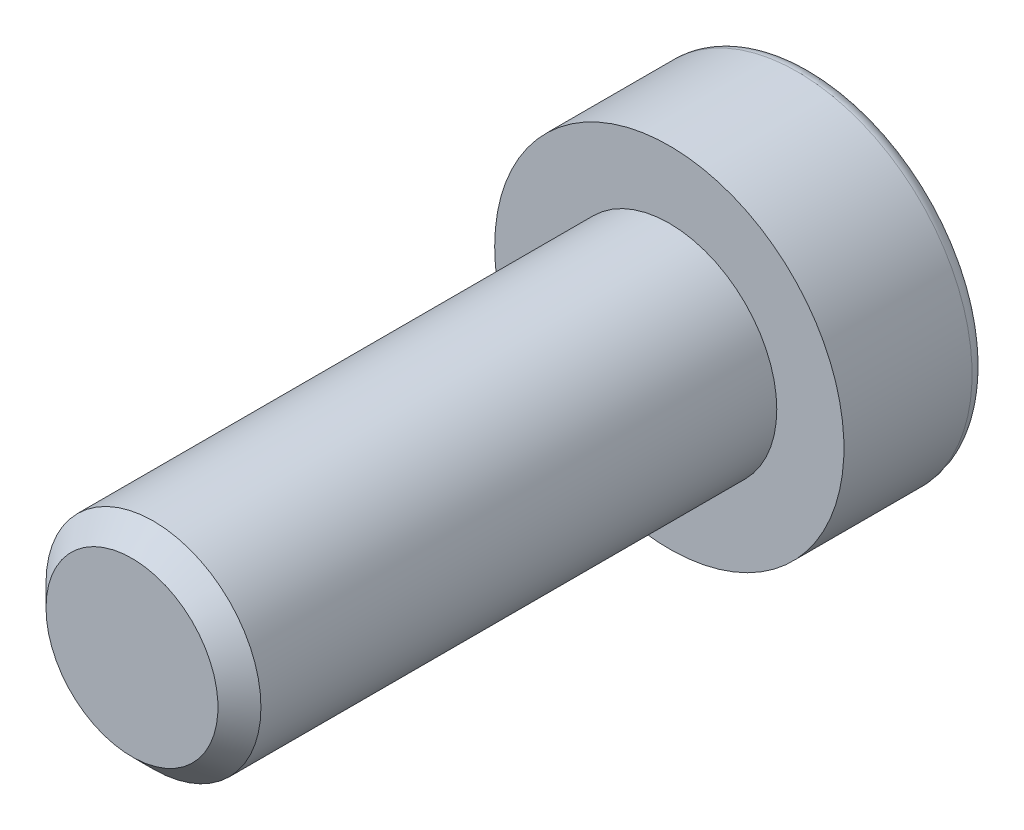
ISO-10303-21;
HEADER;
FILE_DESCRIPTION(('STEP AP214'),'2;1');
FILE_NAME('part.step','',(''),(''),'','','');
FILE_SCHEMA(('AUTOMOTIVE_DESIGN { 1 0 10303 214 1 1 1 1 }'));
ENDSEC;
DATA;
#1=APPLICATION_CONTEXT('core data for automotive mechanical design processes');
#2=APPLICATION_PROTOCOL_DEFINITION('international standard','automotive_design',2000,#1);
#3=PRODUCT_CONTEXT('',#1,'mechanical');
#4=PRODUCT('Part','Part','',(#3));
#5=PRODUCT_RELATED_PRODUCT_CATEGORY('part','',(#4));
#6=PRODUCT_DEFINITION_FORMATION('','',#4);
#7=PRODUCT_DEFINITION_CONTEXT('part definition',#1,'design');
#8=PRODUCT_DEFINITION('design','',#6,#7);
#9=PRODUCT_DEFINITION_SHAPE('','',#8);
#10=(LENGTH_UNIT() NAMED_UNIT(*) SI_UNIT(.MILLI.,.METRE.));
#11=(NAMED_UNIT(*) PLANE_ANGLE_UNIT() SI_UNIT($,.RADIAN.));
#12=(NAMED_UNIT(*) SI_UNIT($,.STERADIAN.) SOLID_ANGLE_UNIT());
#13=UNCERTAINTY_MEASURE_WITH_UNIT(LENGTH_MEASURE(1.E-05),#10,'distance_accuracy_value','');
#14=(GEOMETRIC_REPRESENTATION_CONTEXT(3) GLOBAL_UNCERTAINTY_ASSIGNED_CONTEXT((#13)) GLOBAL_UNIT_ASSIGNED_CONTEXT((#10,
#11,#12)) REPRESENTATION_CONTEXT('',''));
#15=CARTESIAN_POINT('',(0.,0.,0.));
#16=DIRECTION('',(0.,0.,1.));
#17=DIRECTION('',(1.,0.,0.));
#18=AXIS2_PLACEMENT_3D('',#15,#16,#17);
#19=CARTESIAN_POINT('',(0.,0.,-5.3));
#20=DIRECTION('',(0.,0.,1.));
#21=DIRECTION('',(1.,0.,0.));
#22=AXIS2_PLACEMENT_3D('',#19,#20,#21);
#23=PLANE('',#22);
#24=CARTESIAN_POINT('',(0.,0.,-5.3));
#25=DIRECTION('',(0.,0.,-1.));
#26=DIRECTION('',(-1.,0.,0.));
#27=AXIS2_PLACEMENT_3D('',#24,#25,#26);
#28=CIRCLE('',#27,5.97);
#29=CARTESIAN_POINT('',(-5.97,0.,-5.3));
#30=VERTEX_POINT('',#29);
#31=EDGE_CURVE('E141',#30,#30,#28,.T.);
#32=ORIENTED_EDGE('',*,*,#31,.T.);
#33=EDGE_LOOP('',(#32));
#34=FACE_BOUND('',#33,.T.);
#35=DIRECTION('',(-0.86602540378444,0.499999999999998,0.));
#36=VECTOR('',#35,1.);
#37=CARTESIAN_POINT('',(0.,3.46410161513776,-5.3));
#38=LINE('',#37,#36);
#39=CARTESIAN_POINT('',(3.,1.73205080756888,-5.3));
#40=VERTEX_POINT('',#39);
#41=CARTESIAN_POINT('',(0.,3.46410161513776,-5.3));
#42=VERTEX_POINT('',#41);
#43=EDGE_CURVE('E45',#40,#42,#38,.T.);
#44=ORIENTED_EDGE('',*,*,#43,.T.);
#45=DIRECTION('',(-0.866025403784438,-0.500000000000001,0.));
#46=VECTOR('',#45,1.);
#47=CARTESIAN_POINT('',(0.,3.46410161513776,-5.3));
#48=LINE('',#47,#46);
#49=CARTESIAN_POINT('',(-3.,1.73205080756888,-5.3));
#50=VERTEX_POINT('',#49);
#51=EDGE_CURVE('E85',#42,#50,#48,.T.);
#52=ORIENTED_EDGE('',*,*,#51,.T.);
#53=DIRECTION('',(0.,-1.,0.));
#54=VECTOR('',#53,1.);
#55=CARTESIAN_POINT('',(-3.,-1.73205080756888,-5.3));
#56=LINE('',#55,#54);
#57=CARTESIAN_POINT('',(-3.,-1.73205080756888,-5.3));
#58=VERTEX_POINT('',#57);
#59=EDGE_CURVE('E93',#50,#58,#56,.T.);
#60=ORIENTED_EDGE('',*,*,#59,.T.);
#61=DIRECTION('',(0.866025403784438,-0.500000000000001,0.));
#62=VECTOR('',#61,1.);
#63=CARTESIAN_POINT('',(0.,-3.46410161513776,-5.3));
#64=LINE('',#63,#62);
#65=CARTESIAN_POINT('',(0.,-3.46410161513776,-5.3));
#66=VERTEX_POINT('',#65);
#67=EDGE_CURVE('E111',#58,#66,#64,.T.);
#68=ORIENTED_EDGE('',*,*,#67,.T.);
#69=DIRECTION('',(0.86602540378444,0.499999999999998,0.));
#70=VECTOR('',#69,1.);
#71=CARTESIAN_POINT('',(0.,-3.46410161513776,-5.3));
#72=LINE('',#71,#70);
#73=CARTESIAN_POINT('',(3.,-1.73205080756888,-5.3));
#74=VERTEX_POINT('',#73);
#75=EDGE_CURVE('E114',#66,#74,#72,.T.);
#76=ORIENTED_EDGE('',*,*,#75,.T.);
#77=DIRECTION('',(0.,1.,0.));
#78=VECTOR('',#77,1.);
#79=CARTESIAN_POINT('',(3.,-1.73205080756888,-5.3));
#80=LINE('',#79,#78);
#81=EDGE_CURVE('E104',#74,#40,#80,.T.);
#82=ORIENTED_EDGE('',*,*,#81,.T.);
#83=EDGE_LOOP('',(#44,#52,#60,#68,#76,#82));
#84=FACE_BOUND('',#83,.T.);
#85=ADVANCED_FACE('F31',(#34,#84),#23,.F.);
#86=CARTESIAN_POINT('',(0.,0.,-4.77));
#87=DIRECTION('',(0.,0.,-1.));
#88=DIRECTION('',(-1.,0.,0.));
#89=AXIS2_PLACEMENT_3D('',#86,#87,#88);
#90=TOROIDAL_SURFACE('',#89,5.97,0.53);
#91=ORIENTED_EDGE('',*,*,#31,.F.);
#92=EDGE_LOOP('',(#91));
#93=FACE_BOUND('',#92,.T.);
#94=CARTESIAN_POINT('',(0.,0.,-4.77));
#95=DIRECTION('',(0.,0.,-1.));
#96=DIRECTION('',(-1.,0.,0.));
#97=AXIS2_PLACEMENT_3D('',#94,#95,#96);
#98=CIRCLE('',#97,6.5);
#99=CARTESIAN_POINT('',(-6.5,0.,-4.77));
#100=VERTEX_POINT('',#99);
#101=EDGE_CURVE('E138',#100,#100,#98,.T.);
#102=ORIENTED_EDGE('',*,*,#101,.T.);
#103=EDGE_LOOP('',(#102));
#104=FACE_BOUND('',#103,.T.);
#105=ADVANCED_FACE('F160',(#93,#104),#90,.T.);
#106=CARTESIAN_POINT('',(0.,0.,0.));
#107=DIRECTION('',(0.,0.,-1.));
#108=DIRECTION('',(-1.,0.,0.));
#109=AXIS2_PLACEMENT_3D('',#106,#107,#108);
#110=CYLINDRICAL_SURFACE('',#109,6.5);
#111=ORIENTED_EDGE('',*,*,#101,.F.);
#112=EDGE_LOOP('',(#111));
#113=FACE_BOUND('',#112,.T.);
#114=CARTESIAN_POINT('',(0.,0.,0.));
#115=DIRECTION('',(0.,0.,-1.));
#116=DIRECTION('',(-1.,0.,0.));
#117=AXIS2_PLACEMENT_3D('',#114,#115,#116);
#118=CIRCLE('',#117,6.5);
#119=CARTESIAN_POINT('',(-6.5,0.,0.));
#120=VERTEX_POINT('',#119);
#121=EDGE_CURVE('E99',#120,#120,#118,.T.);
#122=ORIENTED_EDGE('',*,*,#121,.T.);
#123=EDGE_LOOP('',(#122));
#124=FACE_BOUND('',#123,.T.);
#125=ADVANCED_FACE('F165',(#113,#124),#110,.T.);
#126=CARTESIAN_POINT('',(0.,0.,0.));
#127=DIRECTION('',(0.,0.,-1.));
#128=DIRECTION('',(-1.,0.,0.));
#129=AXIS2_PLACEMENT_3D('',#126,#127,#128);
#130=PLANE('',#129);
#131=CARTESIAN_POINT('',(0.,0.,0.));
#132=DIRECTION('',(0.,0.,1.));
#133=DIRECTION('',(1.,0.,0.));
#134=AXIS2_PLACEMENT_3D('',#131,#132,#133);
#135=CIRCLE('',#134,4.);
#136=CARTESIAN_POINT('',(4.,0.,0.));
#137=VERTEX_POINT('',#136);
#138=EDGE_CURVE('E105',#137,#137,#135,.T.);
#139=ORIENTED_EDGE('',*,*,#138,.F.);
#140=EDGE_LOOP('',(#139));
#141=FACE_BOUND('',#140,.T.);
#142=ORIENTED_EDGE('',*,*,#121,.F.);
#143=EDGE_LOOP('',(#142));
#144=FACE_BOUND('',#143,.T.);
#145=ADVANCED_FACE('F173',(#141,#144),#130,.F.);
#146=CARTESIAN_POINT('',(0.,3.46410161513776,-1.3));
#147=DIRECTION('',(-0.499999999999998,-0.86602540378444,0.));
#148=DIRECTION('',(0.86602540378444,-0.499999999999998,0.));
#149=AXIS2_PLACEMENT_3D('',#146,#147,#148);
#150=PLANE('',#149);
#151=ORIENTED_EDGE('',*,*,#43,.F.);
#152=DIRECTION('',(0.,0.,-1.));
#153=VECTOR('',#152,1.);
#154=CARTESIAN_POINT('',(3.,1.73205080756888,-1.3));
#155=LINE('',#154,#153);
#156=CARTESIAN_POINT('',(3.,1.73205080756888,-1.3));
#157=VERTEX_POINT('',#156);
#158=EDGE_CURVE('E127',#157,#40,#155,.T.);
#159=ORIENTED_EDGE('',*,*,#158,.F.);
#160=DIRECTION('',(-0.86602540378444,0.499999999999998,0.));
#161=VECTOR('',#160,1.);
#162=CARTESIAN_POINT('',(0.,3.46410161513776,-1.3));
#163=LINE('',#162,#161);
#164=CARTESIAN_POINT('',(0.,3.46410161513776,-1.3));
#165=VERTEX_POINT('',#164);
#166=EDGE_CURVE('E98',#157,#165,#163,.T.);
#167=ORIENTED_EDGE('',*,*,#166,.T.);
#168=DIRECTION('',(0.,0.,-1.));
#169=VECTOR('',#168,1.);
#170=CARTESIAN_POINT('',(0.,3.46410161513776,-1.3));
#171=LINE('',#170,#169);
#172=EDGE_CURVE('E87',#165,#42,#171,.T.);
#173=ORIENTED_EDGE('',*,*,#172,.T.);
#174=EDGE_LOOP('',(#151,#159,#167,#173));
#175=FACE_BOUND('',#174,.T.);
#176=ADVANCED_FACE('F96',(#175),#150,.T.);
#177=CARTESIAN_POINT('',(0.,3.46410161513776,-1.3));
#178=DIRECTION('',(0.500000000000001,-0.866025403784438,0.));
#179=DIRECTION('',(0.866025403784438,0.500000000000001,0.));
#180=AXIS2_PLACEMENT_3D('',#177,#178,#179);
#181=PLANE('',#180);
#182=ORIENTED_EDGE('',*,*,#51,.F.);
#183=ORIENTED_EDGE('',*,*,#172,.F.);
#184=DIRECTION('',(-0.866025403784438,-0.500000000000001,0.));
#185=VECTOR('',#184,1.);
#186=CARTESIAN_POINT('',(0.,3.46410161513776,-1.3));
#187=LINE('',#186,#185);
#188=CARTESIAN_POINT('',(-3.,1.73205080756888,-1.3));
#189=VERTEX_POINT('',#188);
#190=EDGE_CURVE('E118',#165,#189,#187,.T.);
#191=ORIENTED_EDGE('',*,*,#190,.T.);
#192=DIRECTION('',(0.,0.,-1.));
#193=VECTOR('',#192,1.);
#194=CARTESIAN_POINT('',(-3.,1.73205080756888,-1.3));
#195=LINE('',#194,#193);
#196=EDGE_CURVE('E89',#189,#50,#195,.T.);
#197=ORIENTED_EDGE('',*,*,#196,.T.);
#198=EDGE_LOOP('',(#182,#183,#191,#197));
#199=FACE_BOUND('',#198,.T.);
#200=ADVANCED_FACE('F86',(#199),#181,.T.);
#201=CARTESIAN_POINT('',(-3.,-1.73205080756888,-1.3));
#202=DIRECTION('',(1.,0.,0.));
#203=DIRECTION('',(0.,0.,-1.));
#204=AXIS2_PLACEMENT_3D('',#201,#202,#203);
#205=PLANE('',#204);
#206=ORIENTED_EDGE('',*,*,#59,.F.);
#207=ORIENTED_EDGE('',*,*,#196,.F.);
#208=DIRECTION('',(0.,-1.,0.));
#209=VECTOR('',#208,1.);
#210=CARTESIAN_POINT('',(-3.,-1.73205080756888,-1.3));
#211=LINE('',#210,#209);
#212=CARTESIAN_POINT('',(-3.,-1.73205080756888,-1.3));
#213=VERTEX_POINT('',#212);
#214=EDGE_CURVE('E120',#189,#213,#211,.T.);
#215=ORIENTED_EDGE('',*,*,#214,.T.);
#216=DIRECTION('',(0.,0.,-1.));
#217=VECTOR('',#216,1.);
#218=CARTESIAN_POINT('',(-3.,-1.73205080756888,-1.3));
#219=LINE('',#218,#217);
#220=EDGE_CURVE('E133',#213,#58,#219,.T.);
#221=ORIENTED_EDGE('',*,*,#220,.T.);
#222=EDGE_LOOP('',(#206,#207,#215,#221));
#223=FACE_BOUND('',#222,.T.);
#224=ADVANCED_FACE('F188',(#223),#205,.T.);
#225=CARTESIAN_POINT('',(0.,-3.46410161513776,-1.3));
#226=DIRECTION('',(0.500000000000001,0.866025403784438,0.));
#227=DIRECTION('',(-0.866025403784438,0.500000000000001,0.));
#228=AXIS2_PLACEMENT_3D('',#225,#226,#227);
#229=PLANE('',#228);
#230=ORIENTED_EDGE('',*,*,#67,.F.);
#231=ORIENTED_EDGE('',*,*,#220,.F.);
#232=DIRECTION('',(0.866025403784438,-0.500000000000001,0.));
#233=VECTOR('',#232,1.);
#234=CARTESIAN_POINT('',(0.,-3.46410161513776,-1.3));
#235=LINE('',#234,#233);
#236=CARTESIAN_POINT('',(0.,-3.46410161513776,-1.3));
#237=VERTEX_POINT('',#236);
#238=EDGE_CURVE('E122',#213,#237,#235,.T.);
#239=ORIENTED_EDGE('',*,*,#238,.T.);
#240=DIRECTION('',(0.,0.,-1.));
#241=VECTOR('',#240,1.);
#242=CARTESIAN_POINT('',(0.,-3.46410161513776,-1.3));
#243=LINE('',#242,#241);
#244=EDGE_CURVE('E131',#237,#66,#243,.T.);
#245=ORIENTED_EDGE('',*,*,#244,.T.);
#246=EDGE_LOOP('',(#230,#231,#239,#245));
#247=FACE_BOUND('',#246,.T.);
#248=ADVANCED_FACE('F191',(#247),#229,.T.);
#249=CARTESIAN_POINT('',(0.,-3.46410161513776,-1.3));
#250=DIRECTION('',(-0.499999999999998,0.86602540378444,0.));
#251=DIRECTION('',(-0.86602540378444,-0.499999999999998,0.));
#252=AXIS2_PLACEMENT_3D('',#249,#250,#251);
#253=PLANE('',#252);
#254=ORIENTED_EDGE('',*,*,#75,.F.);
#255=ORIENTED_EDGE('',*,*,#244,.F.);
#256=DIRECTION('',(0.86602540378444,0.499999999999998,0.));
#257=VECTOR('',#256,1.);
#258=CARTESIAN_POINT('',(0.,-3.46410161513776,-1.3));
#259=LINE('',#258,#257);
#260=CARTESIAN_POINT('',(3.,-1.73205080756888,-1.3));
#261=VERTEX_POINT('',#260);
#262=EDGE_CURVE('E124',#237,#261,#259,.T.);
#263=ORIENTED_EDGE('',*,*,#262,.T.);
#264=DIRECTION('',(0.,0.,-1.));
#265=VECTOR('',#264,1.);
#266=CARTESIAN_POINT('',(3.,-1.73205080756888,-1.3));
#267=LINE('',#266,#265);
#268=EDGE_CURVE('E129',#261,#74,#267,.T.);
#269=ORIENTED_EDGE('',*,*,#268,.T.);
#270=EDGE_LOOP('',(#254,#255,#263,#269));
#271=FACE_BOUND('',#270,.T.);
#272=ADVANCED_FACE('F195',(#271),#253,.T.);
#273=CARTESIAN_POINT('',(3.,-1.73205080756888,-1.3));
#274=DIRECTION('',(-1.,0.,0.));
#275=DIRECTION('',(0.,0.,1.));
#276=AXIS2_PLACEMENT_3D('',#273,#274,#275);
#277=PLANE('',#276);
#278=ORIENTED_EDGE('',*,*,#81,.F.);
#279=ORIENTED_EDGE('',*,*,#268,.F.);
#280=DIRECTION('',(0.,1.,0.));
#281=VECTOR('',#280,1.);
#282=CARTESIAN_POINT('',(3.,-1.73205080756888,-1.3));
#283=LINE('',#282,#281);
#284=EDGE_CURVE('E52',#261,#157,#283,.T.);
#285=ORIENTED_EDGE('',*,*,#284,.T.);
#286=ORIENTED_EDGE('',*,*,#158,.T.);
#287=EDGE_LOOP('',(#278,#279,#285,#286));
#288=FACE_BOUND('',#287,.T.);
#289=ADVANCED_FACE('F199',(#288),#277,.T.);
#290=CARTESIAN_POINT('',(3.,1.73205080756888,-1.3));
#291=DIRECTION('',(0.,0.,1.));
#292=DIRECTION('',(1.,0.,0.));
#293=AXIS2_PLACEMENT_3D('',#290,#291,#292);
#294=PLANE('',#293);
#295=ORIENTED_EDGE('',*,*,#166,.F.);
#296=ORIENTED_EDGE('',*,*,#284,.F.);
#297=ORIENTED_EDGE('',*,*,#262,.F.);
#298=ORIENTED_EDGE('',*,*,#238,.F.);
#299=ORIENTED_EDGE('',*,*,#214,.F.);
#300=ORIENTED_EDGE('',*,*,#190,.F.);
#301=EDGE_LOOP('',(#295,#296,#297,#298,#299,#300));
#302=FACE_BOUND('',#301,.T.);
#303=ADVANCED_FACE('F203',(#302),#294,.F.);
#304=CARTESIAN_POINT('',(0.,0.,20.));
#305=DIRECTION('',(0.,0.,1.));
#306=DIRECTION('',(1.,0.,0.));
#307=AXIS2_PLACEMENT_3D('',#304,#305,#306);
#308=PLANE('',#307);
#309=CARTESIAN_POINT('',(0.,0.,20.));
#310=DIRECTION('',(0.,0.,1.));
#311=DIRECTION('',(1.,0.,0.));
#312=AXIS2_PLACEMENT_3D('',#309,#310,#311);
#313=CIRCLE('',#312,3.2);
#314=CARTESIAN_POINT('',(-3.2,0.,20.));
#315=VERTEX_POINT('',#314);
#316=EDGE_CURVE('E38',#315,#315,#313,.T.);
#317=ORIENTED_EDGE('',*,*,#316,.T.);
#318=EDGE_LOOP('',(#317));
#319=FACE_BOUND('',#318,.T.);
#320=ADVANCED_FACE('F146',(#319),#308,.T.);
#321=CARTESIAN_POINT('',(0.,0.,0.));
#322=DIRECTION('',(0.,0.,1.));
#323=DIRECTION('',(1.,0.,0.));
#324=AXIS2_PLACEMENT_3D('',#321,#322,#323);
#325=CYLINDRICAL_SURFACE('',#324,4.);
#326=CARTESIAN_POINT('',(0.,0.,19.2));
#327=DIRECTION('',(0.,0.,1.));
#328=DIRECTION('',(1.,0.,0.));
#329=AXIS2_PLACEMENT_3D('',#326,#327,#328);
#330=CIRCLE('',#329,4.);
#331=CARTESIAN_POINT('',(-4.,0.,19.2));
#332=VERTEX_POINT('',#331);
#333=EDGE_CURVE('E11',#332,#332,#330,.F.);
#334=ORIENTED_EDGE('',*,*,#333,.T.);
#335=EDGE_LOOP('',(#334));
#336=FACE_BOUND('',#335,.T.);
#337=ORIENTED_EDGE('',*,*,#138,.T.);
#338=EDGE_LOOP('',(#337));
#339=FACE_BOUND('',#338,.T.);
#340=ADVANCED_FACE('F150',(#336,#339),#325,.T.);
#341=CARTESIAN_POINT('',(0.,0.,20.));
#342=DIRECTION('',(0.,0.,-1.));
#343=DIRECTION('',(-1.,0.,0.));
#344=AXIS2_PLACEMENT_3D('',#341,#342,#343);
#345=CONICAL_SURFACE('',#344,3.2,0.785398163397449);
#346=CARTESIAN_POINT('',(-4.,0.,19.2));
#347=CARTESIAN_POINT('',(-3.99166666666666,0.,19.2083333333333));
#348=CARTESIAN_POINT('',(-3.98333333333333,0.,19.2166666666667));
#349=CARTESIAN_POINT('',(-3.96666666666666,0.,19.2333333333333));
#350=CARTESIAN_POINT('',(-3.95833333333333,0.,19.2416666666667));
#351=CARTESIAN_POINT('',(-3.94166666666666,0.,19.2583333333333));
#352=CARTESIAN_POINT('',(-3.93333333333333,0.,19.2666666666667));
#353=CARTESIAN_POINT('',(-3.91666666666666,0.,19.2833333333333));
#354=CARTESIAN_POINT('',(-3.90833333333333,0.,19.2916666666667));
#355=CARTESIAN_POINT('',(-3.89166666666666,0.,19.3083333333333));
#356=CARTESIAN_POINT('',(-3.88333333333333,0.,19.3166666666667));
#357=CARTESIAN_POINT('',(-3.86666666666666,0.,19.3333333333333));
#358=CARTESIAN_POINT('',(-3.85833333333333,0.,19.3416666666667));
#359=CARTESIAN_POINT('',(-3.84166666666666,0.,19.3583333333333));
#360=CARTESIAN_POINT('',(-3.83333333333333,0.,19.3666666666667));
#361=CARTESIAN_POINT('',(-3.81666666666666,0.,19.3833333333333));
#362=CARTESIAN_POINT('',(-3.80833333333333,0.,19.3916666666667));
#363=CARTESIAN_POINT('',(-3.79166666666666,0.,19.4083333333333));
#364=CARTESIAN_POINT('',(-3.78333333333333,0.,19.4166666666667));
#365=CARTESIAN_POINT('',(-3.76666666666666,0.,19.4333333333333));
#366=CARTESIAN_POINT('',(-3.75833333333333,0.,19.4416666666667));
#367=CARTESIAN_POINT('',(-3.74166666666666,0.,19.4583333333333));
#368=CARTESIAN_POINT('',(-3.73333333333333,0.,19.4666666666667));
#369=CARTESIAN_POINT('',(-3.71666666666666,0.,19.4833333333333));
#370=CARTESIAN_POINT('',(-3.70833333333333,0.,19.4916666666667));
#371=CARTESIAN_POINT('',(-3.69166666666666,0.,19.5083333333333));
#372=CARTESIAN_POINT('',(-3.68333333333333,0.,19.5166666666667));
#373=CARTESIAN_POINT('',(-3.66666666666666,0.,19.5333333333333));
#374=CARTESIAN_POINT('',(-3.65833333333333,0.,19.5416666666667));
#375=CARTESIAN_POINT('',(-3.64166666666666,0.,19.5583333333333));
#376=CARTESIAN_POINT('',(-3.63333333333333,0.,19.5666666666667));
#377=CARTESIAN_POINT('',(-3.61666666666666,0.,19.5833333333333));
#378=CARTESIAN_POINT('',(-3.60833333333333,0.,19.5916666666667));
#379=CARTESIAN_POINT('',(-3.59166666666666,0.,19.6083333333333));
#380=CARTESIAN_POINT('',(-3.58333333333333,0.,19.6166666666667));
#381=CARTESIAN_POINT('',(-3.56666666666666,0.,19.6333333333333));
#382=CARTESIAN_POINT('',(-3.55833333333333,0.,19.6416666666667));
#383=CARTESIAN_POINT('',(-3.54166666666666,0.,19.6583333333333));
#384=CARTESIAN_POINT('',(-3.53333333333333,0.,19.6666666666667));
#385=CARTESIAN_POINT('',(-3.51666666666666,0.,19.6833333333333));
#386=CARTESIAN_POINT('',(-3.50833333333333,0.,19.6916666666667));
#387=CARTESIAN_POINT('',(-3.49166666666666,0.,19.7083333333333));
#388=CARTESIAN_POINT('',(-3.48333333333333,0.,19.7166666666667));
#389=CARTESIAN_POINT('',(-3.46666666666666,0.,19.7333333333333));
#390=CARTESIAN_POINT('',(-3.45833333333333,0.,19.7416666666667));
#391=CARTESIAN_POINT('',(-3.44166666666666,0.,19.7583333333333));
#392=CARTESIAN_POINT('',(-3.43333333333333,0.,19.7666666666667));
#393=CARTESIAN_POINT('',(-3.41666666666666,0.,19.7833333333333));
#394=CARTESIAN_POINT('',(-3.40833333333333,0.,19.7916666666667));
#395=CARTESIAN_POINT('',(-3.39166666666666,0.,19.8083333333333));
#396=CARTESIAN_POINT('',(-3.38333333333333,0.,19.8166666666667));
#397=CARTESIAN_POINT('',(-3.36666666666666,0.,19.8333333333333));
#398=CARTESIAN_POINT('',(-3.35833333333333,0.,19.8416666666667));
#399=CARTESIAN_POINT('',(-3.34166666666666,0.,19.8583333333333));
#400=CARTESIAN_POINT('',(-3.33333333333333,0.,19.8666666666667));
#401=CARTESIAN_POINT('',(-3.31666666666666,0.,19.8833333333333));
#402=CARTESIAN_POINT('',(-3.30833333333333,0.,19.8916666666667));
#403=CARTESIAN_POINT('',(-3.29166666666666,0.,19.9083333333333));
#404=CARTESIAN_POINT('',(-3.28333333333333,0.,19.9166666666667));
#405=CARTESIAN_POINT('',(-3.26666666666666,0.,19.9333333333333));
#406=CARTESIAN_POINT('',(-3.25833333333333,0.,19.9416666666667));
#407=CARTESIAN_POINT('',(-3.24166666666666,0.,19.9583333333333));
#408=CARTESIAN_POINT('',(-3.23333333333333,0.,19.9666666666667));
#409=CARTESIAN_POINT('',(-3.21666666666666,0.,19.9833333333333));
#410=CARTESIAN_POINT('',(-3.20833333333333,0.,19.9916666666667));
#411=CARTESIAN_POINT('',(-3.2,0.,20.));
#412=B_SPLINE_CURVE_WITH_KNOTS('',3,(#346,#347,#348,#349,#350,#351,#352,#353,#354,#355,#356,
#357,#358,#359,#360,#361,#362,#363,#364,#365,#366,#367,#368,#369,#370,#371,#372,#373,#374,#375,
#376,#377,#378,#379,#380,#381,#382,#383,#384,#385,#386,#387,#388,#389,#390,#391,#392,#393,#394,
#395,#396,#397,#398,#399,#400,#401,#402,#403,#404,#405,#406,#407,#408,#409,#410,#411),
.UNSPECIFIED.,.F.,.F.,(4,2,2,2,2,2,2,2,2,2,2,2,2,2,2,2,2,2,2,2,2,2,2,2,2,2,2,2,2,2,2,2,4),(0.,
0.0353553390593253,0.0707106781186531,0.106066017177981,0.141421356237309,0.176776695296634,
0.212132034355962,0.24748737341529,0.282842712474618,0.318198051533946,0.353553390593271,
0.388908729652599,0.424264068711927,0.459619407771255,0.49497474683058,0.530330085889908,
0.565685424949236,0.601040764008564,0.636396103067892,0.671751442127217,0.707106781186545,
0.742462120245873,0.777817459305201,0.813172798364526,0.848528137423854,0.883883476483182,
0.919238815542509,0.954594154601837,0.989949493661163,1.02530483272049,1.06066017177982,
1.09601551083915,1.13137084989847),.UNSPECIFIED.);
#413=EDGE_CURVE('BSEAM148',#332,#315,#412,.T.);
#414=ORIENTED_EDGE('',*,*,#333,.F.);
#415=ORIENTED_EDGE('',*,*,#316,.F.);
#416=ORIENTED_EDGE('',*,*,#413,.T.);
#417=ORIENTED_EDGE('',*,*,#413,.F.);
#418=EDGE_LOOP('',(#414,#416,#415,#417));
#419=FACE_BOUND('',#418,.T.);
#420=ADVANCED_FACE('F148',(#419),#345,.T.);
#421=CLOSED_SHELL('',(#85,#105,#125,#145,#176,#200,#224,#248,#272,#289,#303,#320,#340,#420));
#422=MANIFOLD_SOLID_BREP('B2',#421);
#423=ADVANCED_BREP_SHAPE_REPRESENTATION('',(#18,#422),#14);
#424=SHAPE_DEFINITION_REPRESENTATION(#9,#423);
ENDSEC;
END-ISO-10303-21;
